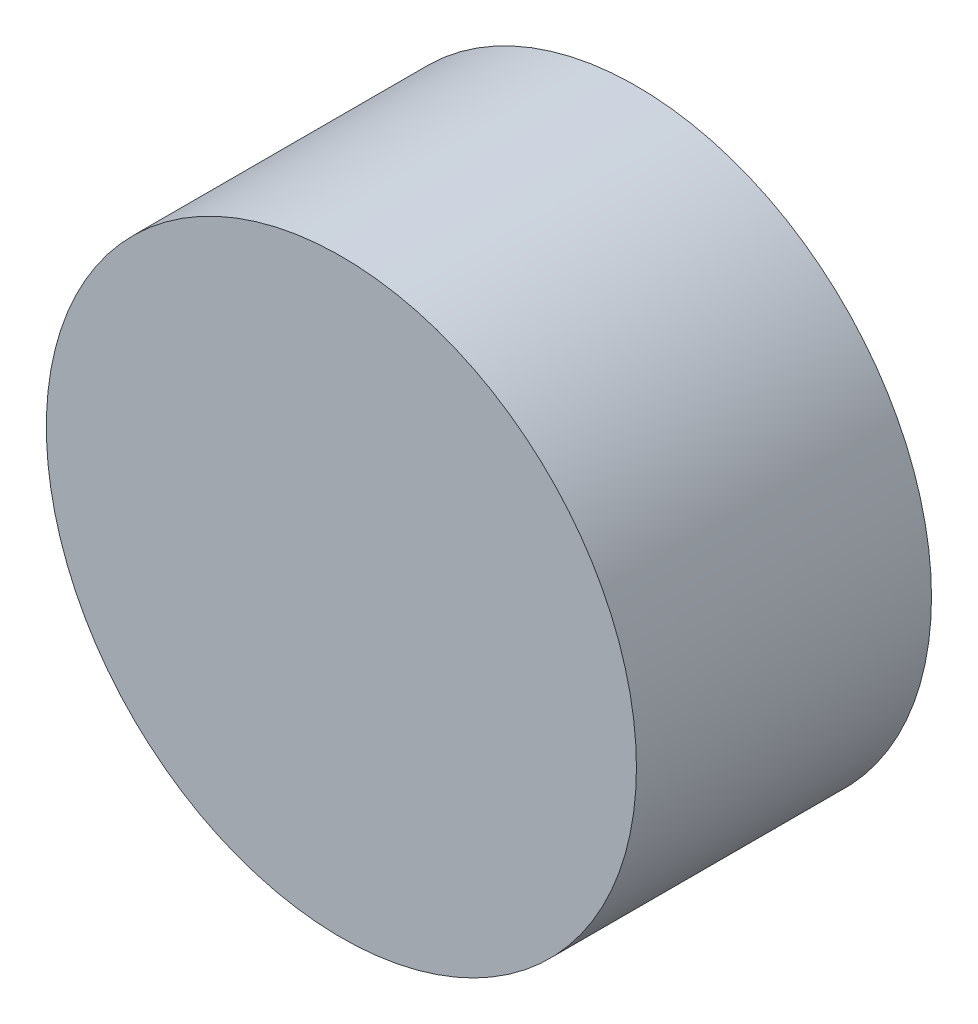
from build123d import *

# Parameters (mm, degrees)
AUFSATZ_LIN_GK_START = -0.5
GK_R                 = 0.5
AUFSATZ_LIN_GK_DEPTH = 0.5


with BuildPart() as part:
    # GK → Aufsatz-Lin_GK (new body)
    with BuildSketch(Plane.XY.offset(AUFSATZ_LIN_GK_START)):
        Circle(GK_R)
    extrude(amount=AUFSATZ_LIN_GK_DEPTH)


solid = part.part
